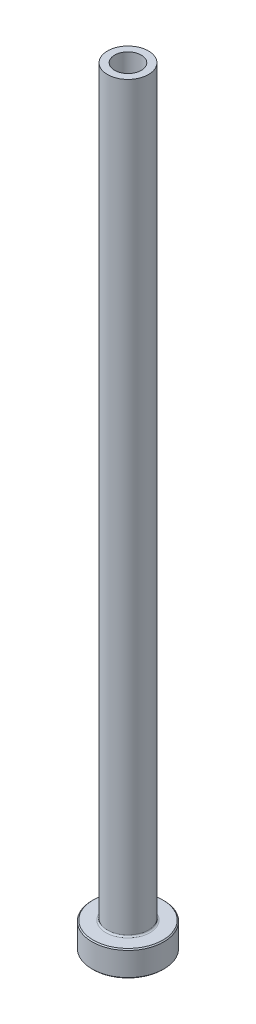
from build123d import *

# Parameters (mm, degrees)
FILLET1_R     = 0.3
CHAMFER1_SIZE = 0.2
CHAMFER3_SIZE = 0.5


with BuildPart() as part:
    # Sketch1 → Revolve1 (revolve)
    with BuildSketch(Plane.XY, mode=Mode.PRIVATE) as revolve1_sk:
        Polygon((-2.6, 150), (-4, 150), (-4, 5), (-7, 5), (-7, 0), (-2.85, 0), (-2.85, 93), (-2.6, 105), align=None)
    revolve(revolve1_sk.sketch.rotate(Axis((0, 92.187680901, 0), (0, -1, 0)), 270), axis=Axis((0, 92.187680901, 0), (0, -1, 0)))

    # Fillet1
    fillet1_edges = [part.edges().sort_by_distance(p)[0] for p in [
        (0, 5, -4),
    ]]
    fillet(fillet1_edges, radius=FILLET1_R)

    # Chamfer1
    chamfer1_edges = [part.edges().sort_by_distance(p)[0] for p in [
        (0, 0, -7),
        (0, 5, -7),
    ]]
    chamfer(chamfer1_edges, length=CHAMFER1_SIZE)

    # Chamfer3
    chamfer3_edges = [part.edges().sort_by_distance(p)[0] for p in [
        (0, 0, -2.85),
    ]]
    chamfer(chamfer3_edges, length=CHAMFER3_SIZE)


solid = part.part
